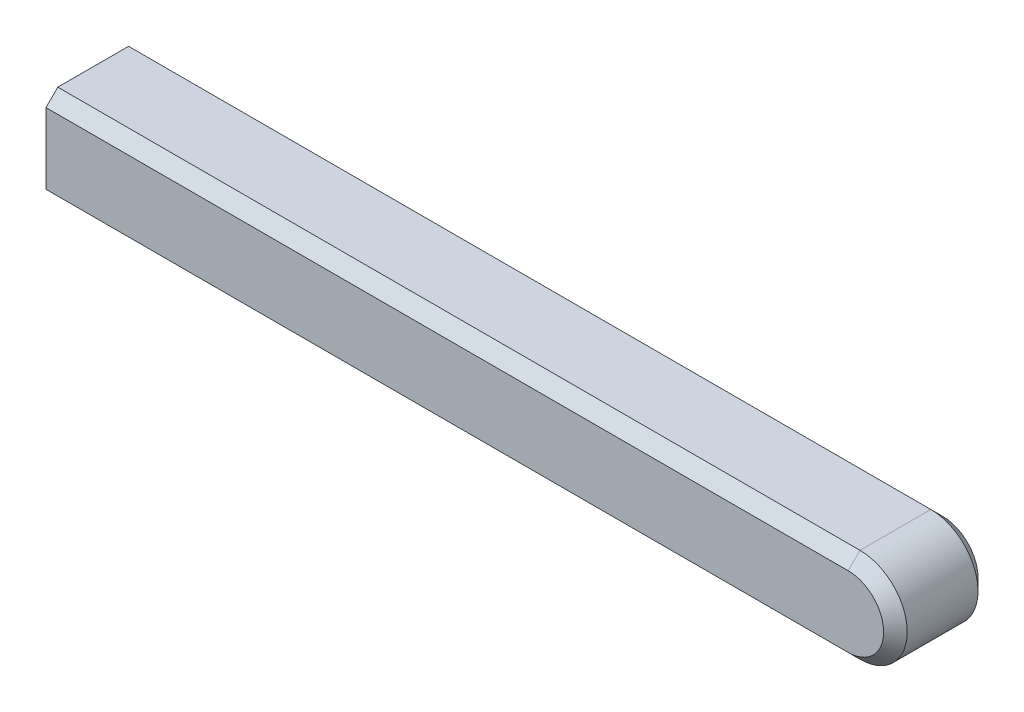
ISO-10303-21;
HEADER;
FILE_DESCRIPTION(('STEP AP214'),'2;1');
FILE_NAME('part.step','',(''),(''),'','','');
FILE_SCHEMA(('AUTOMOTIVE_DESIGN { 1 0 10303 214 1 1 1 1 }'));
ENDSEC;
DATA;
#1=APPLICATION_CONTEXT('core data for automotive mechanical design processes');
#2=APPLICATION_PROTOCOL_DEFINITION('international standard','automotive_design',2000,#1);
#3=PRODUCT_CONTEXT('',#1,'mechanical');
#4=PRODUCT('Part','Part','',(#3));
#5=PRODUCT_RELATED_PRODUCT_CATEGORY('part','',(#4));
#6=PRODUCT_DEFINITION_FORMATION('','',#4);
#7=PRODUCT_DEFINITION_CONTEXT('part definition',#1,'design');
#8=PRODUCT_DEFINITION('design','',#6,#7);
#9=PRODUCT_DEFINITION_SHAPE('','',#8);
#10=(LENGTH_UNIT() NAMED_UNIT(*) SI_UNIT(.MILLI.,.METRE.));
#11=(NAMED_UNIT(*) PLANE_ANGLE_UNIT() SI_UNIT($,.RADIAN.));
#12=(NAMED_UNIT(*) SI_UNIT($,.STERADIAN.) SOLID_ANGLE_UNIT());
#13=UNCERTAINTY_MEASURE_WITH_UNIT(LENGTH_MEASURE(1.E-05),#10,'distance_accuracy_value','');
#14=(GEOMETRIC_REPRESENTATION_CONTEXT(3) GLOBAL_UNCERTAINTY_ASSIGNED_CONTEXT((#13)) GLOBAL_UNIT_ASSIGNED_CONTEXT((#10,
#11,#12)) REPRESENTATION_CONTEXT('',''));
#15=CARTESIAN_POINT('',(0.,0.,0.));
#16=DIRECTION('',(0.,0.,1.));
#17=DIRECTION('',(1.,0.,0.));
#18=AXIS2_PLACEMENT_3D('',#15,#16,#17);
#19=CARTESIAN_POINT('',(0.,0.,2.));
#20=DIRECTION('',(1.,0.,0.));
#21=DIRECTION('',(0.,0.,-1.));
#22=AXIS2_PLACEMENT_3D('',#19,#20,#21);
#23=PLANE('',#22);
#24=DIRECTION('',(0.,0.,-1.));
#25=VECTOR('',#24,1.);
#26=CARTESIAN_POINT('',(0.,2.,2.));
#27=LINE('',#26,#25);
#28=CARTESIAN_POINT('',(0.,2.,1.75));
#29=VERTEX_POINT('',#28);
#30=CARTESIAN_POINT('',(0.,2.,0.250000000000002));
#31=VERTEX_POINT('',#30);
#32=EDGE_CURVE('E107',#29,#31,#27,.T.);
#33=ORIENTED_EDGE('',*,*,#32,.T.);
#34=DIRECTION('',(0.,0.707106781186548,0.707106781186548));
#35=VECTOR('',#34,1.);
#36=CARTESIAN_POINT('',(0.,2.,0.250000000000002));
#37=LINE('',#36,#35);
#38=CARTESIAN_POINT('',(0.,1.75,0.));
#39=VERTEX_POINT('',#38);
#40=EDGE_CURVE('E138',#31,#39,#37,.F.);
#41=ORIENTED_EDGE('',*,*,#40,.T.);
#42=DIRECTION('',(0.,-1.,0.));
#43=VECTOR('',#42,1.);
#44=CARTESIAN_POINT('',(0.,0.,0.));
#45=LINE('',#44,#43);
#46=CARTESIAN_POINT('',(0.,0.250000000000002,0.));
#47=VERTEX_POINT('',#46);
#48=EDGE_CURVE('E161',#39,#47,#45,.T.);
#49=ORIENTED_EDGE('',*,*,#48,.T.);
#50=DIRECTION('',(0.,0.707106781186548,-0.707106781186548));
#51=VECTOR('',#50,1.);
#52=CARTESIAN_POINT('',(0.,0.,0.250000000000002));
#53=LINE('',#52,#51);
#54=CARTESIAN_POINT('',(0.,0.,0.250000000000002));
#55=VERTEX_POINT('',#54);
#56=EDGE_CURVE('E112',#47,#55,#53,.F.);
#57=ORIENTED_EDGE('',*,*,#56,.T.);
#58=DIRECTION('',(0.,0.,-1.));
#59=VECTOR('',#58,1.);
#60=CARTESIAN_POINT('',(0.,0.,2.));
#61=LINE('',#60,#59);
#62=CARTESIAN_POINT('',(0.,0.,1.75));
#63=VERTEX_POINT('',#62);
#64=EDGE_CURVE('E128',#63,#55,#61,.T.);
#65=ORIENTED_EDGE('',*,*,#64,.F.);
#66=DIRECTION('',(0.,0.707106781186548,0.707106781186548));
#67=VECTOR('',#66,1.);
#68=CARTESIAN_POINT('',(0.,0.250000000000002,2.));
#69=LINE('',#68,#67);
#70=CARTESIAN_POINT('',(0.,0.250000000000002,2.));
#71=VERTEX_POINT('',#70);
#72=EDGE_CURVE('E113',#63,#71,#69,.T.);
#73=ORIENTED_EDGE('',*,*,#72,.T.);
#74=DIRECTION('',(0.,-1.,0.));
#75=VECTOR('',#74,1.);
#76=CARTESIAN_POINT('',(0.,0.,2.));
#77=LINE('',#76,#75);
#78=CARTESIAN_POINT('',(0.,1.75,2.));
#79=VERTEX_POINT('',#78);
#80=EDGE_CURVE('E108',#79,#71,#77,.T.);
#81=ORIENTED_EDGE('',*,*,#80,.F.);
#82=DIRECTION('',(0.,0.707106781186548,-0.707106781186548));
#83=VECTOR('',#82,1.);
#84=CARTESIAN_POINT('',(0.,1.75,2.));
#85=LINE('',#84,#83);
#86=EDGE_CURVE('E105',#79,#29,#85,.T.);
#87=ORIENTED_EDGE('',*,*,#86,.T.);
#88=EDGE_LOOP('',(#33,#41,#49,#57,#65,#73,#81,#87));
#89=FACE_BOUND('',#88,.T.);
#90=ADVANCED_FACE('F39',(#89),#23,.F.);
#91=CARTESIAN_POINT('',(0.,0.,2.));
#92=DIRECTION('',(0.,1.,0.));
#93=DIRECTION('',(0.,0.,1.));
#94=AXIS2_PLACEMENT_3D('',#91,#92,#93);
#95=PLANE('',#94);
#96=ORIENTED_EDGE('',*,*,#64,.T.);
#97=DIRECTION('',(1.,0.,0.));
#98=VECTOR('',#97,1.);
#99=CARTESIAN_POINT('',(0.,0.,0.250000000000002));
#100=LINE('',#99,#98);
#101=CARTESIAN_POINT('',(17.,0.,0.250000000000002));
#102=VERTEX_POINT('',#101);
#103=EDGE_CURVE('E152',#55,#102,#100,.T.);
#104=ORIENTED_EDGE('',*,*,#103,.T.);
#105=DIRECTION('',(0.,0.,-1.));
#106=VECTOR('',#105,1.);
#107=CARTESIAN_POINT('',(17.,0.,2.));
#108=LINE('',#107,#106);
#109=CARTESIAN_POINT('',(17.,0.,1.75));
#110=VERTEX_POINT('',#109);
#111=EDGE_CURVE('E132',#110,#102,#108,.T.);
#112=ORIENTED_EDGE('',*,*,#111,.F.);
#113=DIRECTION('',(-1.,0.,0.));
#114=VECTOR('',#113,1.);
#115=CARTESIAN_POINT('',(0.,0.,1.75));
#116=LINE('',#115,#114);
#117=EDGE_CURVE('E150',#110,#63,#116,.T.);
#118=ORIENTED_EDGE('',*,*,#117,.T.);
#119=EDGE_LOOP('',(#96,#104,#112,#118));
#120=FACE_BOUND('',#119,.T.);
#121=ADVANCED_FACE('F172',(#120),#95,.F.);
#122=CARTESIAN_POINT('',(17.,1.,2.));
#123=DIRECTION('',(0.,0.,-1.));
#124=DIRECTION('',(-1.,0.,0.));
#125=AXIS2_PLACEMENT_3D('',#122,#123,#124);
#126=CYLINDRICAL_SURFACE('',#125,1.);
#127=ORIENTED_EDGE('',*,*,#111,.T.);
#128=CARTESIAN_POINT('',(17.,1.,0.250000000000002));
#129=DIRECTION('',(0.,0.,1.));
#130=DIRECTION('',(1.,0.,0.));
#131=AXIS2_PLACEMENT_3D('',#128,#129,#130);
#132=CIRCLE('',#131,1.);
#133=CARTESIAN_POINT('',(17.,2.,0.250000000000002));
#134=VERTEX_POINT('',#133);
#135=EDGE_CURVE('E148',#102,#134,#132,.T.);
#136=ORIENTED_EDGE('',*,*,#135,.T.);
#137=DIRECTION('',(0.,0.,-1.));
#138=VECTOR('',#137,1.);
#139=CARTESIAN_POINT('',(17.,2.,2.));
#140=LINE('',#139,#138);
#141=CARTESIAN_POINT('',(17.,2.,1.75));
#142=VERTEX_POINT('',#141);
#143=EDGE_CURVE('E123',#142,#134,#140,.T.);
#144=ORIENTED_EDGE('',*,*,#143,.F.);
#145=CARTESIAN_POINT('',(17.,1.,1.75));
#146=DIRECTION('',(0.,0.,1.));
#147=DIRECTION('',(1.,0.,0.));
#148=AXIS2_PLACEMENT_3D('',#145,#146,#147);
#149=CIRCLE('',#148,1.);
#150=EDGE_CURVE('E146',#142,#110,#149,.F.);
#151=ORIENTED_EDGE('',*,*,#150,.T.);
#152=EDGE_LOOP('',(#127,#136,#144,#151));
#153=FACE_BOUND('',#152,.T.);
#154=ADVANCED_FACE('F184',(#153),#126,.T.);
#155=CARTESIAN_POINT('',(0.,2.,2.));
#156=DIRECTION('',(0.,-1.,0.));
#157=DIRECTION('',(1.,0.,0.));
#158=AXIS2_PLACEMENT_3D('',#155,#156,#157);
#159=PLANE('',#158);
#160=ORIENTED_EDGE('',*,*,#143,.T.);
#161=DIRECTION('',(-1.,0.,0.));
#162=VECTOR('',#161,1.);
#163=CARTESIAN_POINT('',(0.,2.,0.250000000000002));
#164=LINE('',#163,#162);
#165=EDGE_CURVE('E122',#134,#31,#164,.T.);
#166=ORIENTED_EDGE('',*,*,#165,.T.);
#167=ORIENTED_EDGE('',*,*,#32,.F.);
#168=DIRECTION('',(1.,0.,0.));
#169=VECTOR('',#168,1.);
#170=CARTESIAN_POINT('',(17.,2.,1.75));
#171=LINE('',#170,#169);
#172=EDGE_CURVE('E119',#29,#142,#171,.T.);
#173=ORIENTED_EDGE('',*,*,#172,.T.);
#174=EDGE_LOOP('',(#160,#166,#167,#173));
#175=FACE_BOUND('',#174,.T.);
#176=ADVANCED_FACE('F118',(#175),#159,.F.);
#177=CARTESIAN_POINT('',(17.,1.,2.));
#178=DIRECTION('',(0.,0.,1.));
#179=DIRECTION('',(1.,0.,0.));
#180=AXIS2_PLACEMENT_3D('',#177,#178,#179);
#181=PLANE('',#180);
#182=CARTESIAN_POINT('',(17.,1.,2.));
#183=DIRECTION('',(0.,0.,1.));
#184=DIRECTION('',(1.,0.,0.));
#185=AXIS2_PLACEMENT_3D('',#182,#183,#184);
#186=CIRCLE('',#185,0.749999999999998);
#187=CARTESIAN_POINT('',(17.,0.250000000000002,2.));
#188=VERTEX_POINT('',#187);
#189=CARTESIAN_POINT('',(17.,1.75,2.));
#190=VERTEX_POINT('',#189);
#191=EDGE_CURVE('E48',#188,#190,#186,.T.);
#192=ORIENTED_EDGE('',*,*,#191,.T.);
#193=DIRECTION('',(-1.,0.,0.));
#194=VECTOR('',#193,1.);
#195=CARTESIAN_POINT('',(0.,1.75,2.));
#196=LINE('',#195,#194);
#197=EDGE_CURVE('E11',#190,#79,#196,.T.);
#198=ORIENTED_EDGE('',*,*,#197,.T.);
#199=ORIENTED_EDGE('',*,*,#80,.T.);
#200=DIRECTION('',(1.,0.,0.));
#201=VECTOR('',#200,1.);
#202=CARTESIAN_POINT('',(17.,0.250000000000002,2.));
#203=LINE('',#202,#201);
#204=EDGE_CURVE('E59',#71,#188,#203,.T.);
#205=ORIENTED_EDGE('',*,*,#204,.T.);
#206=EDGE_LOOP('',(#192,#198,#199,#205));
#207=FACE_BOUND('',#206,.T.);
#208=ADVANCED_FACE('F188',(#207),#181,.T.);
#209=CARTESIAN_POINT('',(17.,1.,0.));
#210=DIRECTION('',(0.,0.,1.));
#211=DIRECTION('',(1.,0.,0.));
#212=AXIS2_PLACEMENT_3D('',#209,#210,#211);
#213=PLANE('',#212);
#214=ORIENTED_EDGE('',*,*,#48,.F.);
#215=DIRECTION('',(1.,0.,0.));
#216=VECTOR('',#215,1.);
#217=CARTESIAN_POINT('',(17.,1.75,0.));
#218=LINE('',#217,#216);
#219=CARTESIAN_POINT('',(17.,1.75,0.));
#220=VERTEX_POINT('',#219);
#221=EDGE_CURVE('E144',#39,#220,#218,.T.);
#222=ORIENTED_EDGE('',*,*,#221,.T.);
#223=CARTESIAN_POINT('',(17.,1.,0.));
#224=DIRECTION('',(0.,0.,1.));
#225=DIRECTION('',(1.,0.,0.));
#226=AXIS2_PLACEMENT_3D('',#223,#224,#225);
#227=CIRCLE('',#226,0.749999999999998);
#228=CARTESIAN_POINT('',(17.,0.250000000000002,0.));
#229=VERTEX_POINT('',#228);
#230=EDGE_CURVE('E142',#220,#229,#227,.F.);
#231=ORIENTED_EDGE('',*,*,#230,.T.);
#232=DIRECTION('',(-1.,0.,0.));
#233=VECTOR('',#232,1.);
#234=CARTESIAN_POINT('',(17.,0.250000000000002,0.));
#235=LINE('',#234,#233);
#236=EDGE_CURVE('E140',#229,#47,#235,.T.);
#237=ORIENTED_EDGE('',*,*,#236,.T.);
#238=EDGE_LOOP('',(#214,#222,#231,#237));
#239=FACE_BOUND('',#238,.T.);
#240=ADVANCED_FACE('F190',(#239),#213,.F.);
#241=CARTESIAN_POINT('',(0.,0.,0.250000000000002));
#242=DIRECTION('',(0.,0.707106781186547,0.707106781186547));
#243=DIRECTION('',(0.,-0.707106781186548,0.707106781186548));
#244=AXIS2_PLACEMENT_3D('',#241,#242,#243);
#245=PLANE('',#244);
#246=ORIENTED_EDGE('',*,*,#56,.F.);
#247=ORIENTED_EDGE('',*,*,#236,.F.);
#248=DIRECTION('',(0.,0.707106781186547,-0.707106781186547));
#249=VECTOR('',#248,1.);
#250=CARTESIAN_POINT('',(17.,0.,0.250000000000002));
#251=LINE('',#250,#249);
#252=EDGE_CURVE('E159',#102,#229,#251,.T.);
#253=ORIENTED_EDGE('',*,*,#252,.F.);
#254=ORIENTED_EDGE('',*,*,#103,.F.);
#255=EDGE_LOOP('',(#246,#247,#253,#254));
#256=FACE_BOUND('',#255,.T.);
#257=ADVANCED_FACE('F180',(#256),#245,.F.);
#258=CARTESIAN_POINT('',(17.,1.,0.250000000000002));
#259=DIRECTION('',(0.,0.,1.));
#260=DIRECTION('',(1.,0.,0.));
#261=AXIS2_PLACEMENT_3D('',#258,#259,#260);
#262=CONICAL_SURFACE('',#261,1.,0.785398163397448);
#263=ORIENTED_EDGE('',*,*,#252,.T.);
#264=ORIENTED_EDGE('',*,*,#230,.F.);
#265=DIRECTION('',(0.,-0.707106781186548,-0.707106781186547));
#266=VECTOR('',#265,1.);
#267=CARTESIAN_POINT('',(17.,2.,0.250000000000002));
#268=LINE('',#267,#266);
#269=EDGE_CURVE('E156',#134,#220,#268,.T.);
#270=ORIENTED_EDGE('',*,*,#269,.F.);
#271=ORIENTED_EDGE('',*,*,#135,.F.);
#272=EDGE_LOOP('',(#263,#264,#270,#271));
#273=FACE_BOUND('',#272,.T.);
#274=ADVANCED_FACE('F210',(#273),#262,.T.);
#275=CARTESIAN_POINT('',(0.,2.,0.250000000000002));
#276=DIRECTION('',(0.,-0.707106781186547,0.707106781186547));
#277=DIRECTION('',(0.,-0.707106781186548,-0.707106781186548));
#278=AXIS2_PLACEMENT_3D('',#275,#276,#277);
#279=PLANE('',#278);
#280=ORIENTED_EDGE('',*,*,#269,.T.);
#281=ORIENTED_EDGE('',*,*,#221,.F.);
#282=ORIENTED_EDGE('',*,*,#40,.F.);
#283=ORIENTED_EDGE('',*,*,#165,.F.);
#284=EDGE_LOOP('',(#280,#281,#282,#283));
#285=FACE_BOUND('',#284,.T.);
#286=ADVANCED_FACE('F207',(#285),#279,.F.);
#287=CARTESIAN_POINT('',(17.,0.250000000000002,2.));
#288=DIRECTION('',(0.,-0.707106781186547,0.707106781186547));
#289=DIRECTION('',(0.,-0.707106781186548,-0.707106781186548));
#290=AXIS2_PLACEMENT_3D('',#287,#288,#289);
#291=PLANE('',#290);
#292=ORIENTED_EDGE('',*,*,#72,.F.);
#293=ORIENTED_EDGE('',*,*,#117,.F.);
#294=DIRECTION('',(0.,-0.707106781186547,-0.707106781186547));
#295=VECTOR('',#294,1.);
#296=CARTESIAN_POINT('',(17.,0.250000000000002,2.));
#297=LINE('',#296,#295);
#298=EDGE_CURVE('E43',#188,#110,#297,.T.);
#299=ORIENTED_EDGE('',*,*,#298,.F.);
#300=ORIENTED_EDGE('',*,*,#204,.F.);
#301=EDGE_LOOP('',(#292,#293,#299,#300));
#302=FACE_BOUND('',#301,.T.);
#303=ADVANCED_FACE('F41',(#302),#291,.T.);
#304=CARTESIAN_POINT('',(17.,1.,2.));
#305=DIRECTION('',(0.,0.,-1.));
#306=DIRECTION('',(-1.,0.,0.));
#307=AXIS2_PLACEMENT_3D('',#304,#305,#306);
#308=CONICAL_SURFACE('',#307,0.749999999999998,0.785398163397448);
#309=ORIENTED_EDGE('',*,*,#298,.T.);
#310=ORIENTED_EDGE('',*,*,#150,.F.);
#311=DIRECTION('',(0.,0.707106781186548,-0.707106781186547));
#312=VECTOR('',#311,1.);
#313=CARTESIAN_POINT('',(17.,1.75,2.));
#314=LINE('',#313,#312);
#315=EDGE_CURVE('E127',#190,#142,#314,.T.);
#316=ORIENTED_EDGE('',*,*,#315,.F.);
#317=ORIENTED_EDGE('',*,*,#191,.F.);
#318=EDGE_LOOP('',(#309,#310,#316,#317));
#319=FACE_BOUND('',#318,.T.);
#320=ADVANCED_FACE('F165',(#319),#308,.T.);
#321=CARTESIAN_POINT('',(17.,1.75,2.));
#322=DIRECTION('',(0.,0.707106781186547,0.707106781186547));
#323=DIRECTION('',(0.,-0.707106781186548,0.707106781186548));
#324=AXIS2_PLACEMENT_3D('',#321,#322,#323);
#325=PLANE('',#324);
#326=ORIENTED_EDGE('',*,*,#315,.T.);
#327=ORIENTED_EDGE('',*,*,#172,.F.);
#328=ORIENTED_EDGE('',*,*,#86,.F.);
#329=ORIENTED_EDGE('',*,*,#197,.F.);
#330=EDGE_LOOP('',(#326,#327,#328,#329));
#331=FACE_BOUND('',#330,.T.);
#332=ADVANCED_FACE('F126',(#331),#325,.T.);
#333=CLOSED_SHELL('',(#90,#121,#154,#176,#208,#240,#257,#274,#286,#303,#320,#332));
#334=MANIFOLD_SOLID_BREP('B2',#333);
#335=ADVANCED_BREP_SHAPE_REPRESENTATION('',(#18,#334),#14);
#336=SHAPE_DEFINITION_REPRESENTATION(#9,#335);
ENDSEC;
END-ISO-10303-21;
